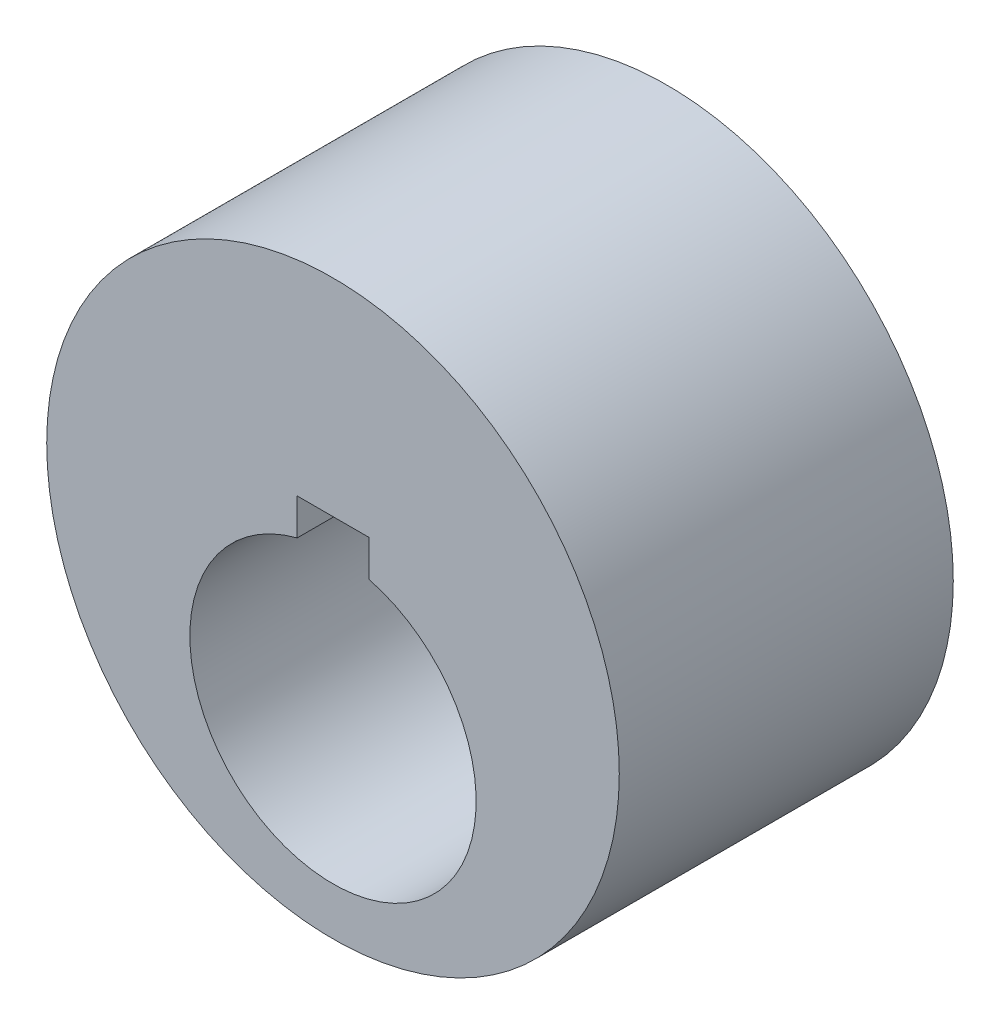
ISO-10303-21;
HEADER;
FILE_DESCRIPTION(('STEP AP214'),'2;1');
FILE_NAME('part.step','',(''),(''),'','','');
FILE_SCHEMA(('AUTOMOTIVE_DESIGN { 1 0 10303 214 1 1 1 1 }'));
ENDSEC;
DATA;
#1=APPLICATION_CONTEXT('core data for automotive mechanical design processes');
#2=APPLICATION_PROTOCOL_DEFINITION('international standard','automotive_design',2000,#1);
#3=PRODUCT_CONTEXT('',#1,'mechanical');
#4=PRODUCT('Part','Part','',(#3));
#5=PRODUCT_RELATED_PRODUCT_CATEGORY('part','',(#4));
#6=PRODUCT_DEFINITION_FORMATION('','',#4);
#7=PRODUCT_DEFINITION_CONTEXT('part definition',#1,'design');
#8=PRODUCT_DEFINITION('design','',#6,#7);
#9=PRODUCT_DEFINITION_SHAPE('','',#8);
#10=(LENGTH_UNIT() NAMED_UNIT(*) SI_UNIT(.MILLI.,.METRE.));
#11=(NAMED_UNIT(*) PLANE_ANGLE_UNIT() SI_UNIT($,.RADIAN.));
#12=(NAMED_UNIT(*) SI_UNIT($,.STERADIAN.) SOLID_ANGLE_UNIT());
#13=UNCERTAINTY_MEASURE_WITH_UNIT(LENGTH_MEASURE(1.E-05),#10,'distance_accuracy_value','');
#14=(GEOMETRIC_REPRESENTATION_CONTEXT(3) GLOBAL_UNCERTAINTY_ASSIGNED_CONTEXT((#13)) GLOBAL_UNIT_ASSIGNED_CONTEXT((#10,
#11,#12)) REPRESENTATION_CONTEXT('',''));
#15=CARTESIAN_POINT('',(0.,0.,0.));
#16=DIRECTION('',(0.,0.,1.));
#17=DIRECTION('',(1.,0.,0.));
#18=AXIS2_PLACEMENT_3D('',#15,#16,#17);
#19=CARTESIAN_POINT('',(0.,12.,42.));
#20=DIRECTION('',(0.,0.,-1.));
#21=DIRECTION('',(-1.,0.,0.));
#22=AXIS2_PLACEMENT_3D('',#19,#20,#21);
#23=CYLINDRICAL_SURFACE('',#22,36.);
#24=CARTESIAN_POINT('',(0.,12.,42.));
#25=DIRECTION('',(0.,0.,-1.));
#26=DIRECTION('',(-1.,0.,0.));
#27=AXIS2_PLACEMENT_3D('',#24,#25,#26);
#28=CIRCLE('',#27,36.);
#29=CARTESIAN_POINT('',(-36.,12.,42.));
#30=VERTEX_POINT('',#29);
#31=EDGE_CURVE('E11',#30,#30,#28,.T.);
#32=ORIENTED_EDGE('',*,*,#31,.T.);
#33=EDGE_LOOP('',(#32));
#34=FACE_BOUND('',#33,.T.);
#35=CARTESIAN_POINT('',(0.,12.,0.));
#36=DIRECTION('',(0.,0.,-1.));
#37=DIRECTION('',(-1.,0.,0.));
#38=AXIS2_PLACEMENT_3D('',#35,#36,#37);
#39=CIRCLE('',#38,36.);
#40=CARTESIAN_POINT('',(-36.,12.,0.));
#41=VERTEX_POINT('',#40);
#42=EDGE_CURVE('E44',#41,#41,#39,.T.);
#43=ORIENTED_EDGE('',*,*,#42,.F.);
#44=EDGE_LOOP('',(#43));
#45=FACE_BOUND('',#44,.T.);
#46=ADVANCED_FACE('F37',(#34,#45),#23,.T.);
#47=CARTESIAN_POINT('',(36.,12.,42.));
#48=DIRECTION('',(0.,0.,1.));
#49=DIRECTION('',(1.,0.,0.));
#50=AXIS2_PLACEMENT_3D('',#47,#48,#49);
#51=PLANE('',#50);
#52=CARTESIAN_POINT('',(0.,0.,42.));
#53=DIRECTION('',(0.,0.,1.));
#54=DIRECTION('',(1.,0.,0.));
#55=AXIS2_PLACEMENT_3D('',#52,#53,#54);
#56=CIRCLE('',#55,18.);
#57=CARTESIAN_POINT('',(-4.5,17.4284250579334,42.));
#58=VERTEX_POINT('',#57);
#59=CARTESIAN_POINT('',(4.50000000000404,17.4284250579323,42.));
#60=VERTEX_POINT('',#59);
#61=EDGE_CURVE('E92',#58,#60,#56,.T.);
#62=ORIENTED_EDGE('',*,*,#61,.F.);
#63=DIRECTION('',(0.,1.,0.));
#64=VECTOR('',#63,1.);
#65=CARTESIAN_POINT('',(-4.5,17.4284250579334,42.));
#66=LINE('',#65,#64);
#67=CARTESIAN_POINT('',(-4.5,22.,42.));
#68=VERTEX_POINT('',#67);
#69=EDGE_CURVE('E102',#58,#68,#66,.T.);
#70=ORIENTED_EDGE('',*,*,#69,.T.);
#71=DIRECTION('',(1.,0.,0.));
#72=VECTOR('',#71,1.);
#73=CARTESIAN_POINT('',(-4.5,22.,42.));
#74=LINE('',#73,#72);
#75=CARTESIAN_POINT('',(4.50000000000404,22.,42.));
#76=VERTEX_POINT('',#75);
#77=EDGE_CURVE('E114',#68,#76,#74,.T.);
#78=ORIENTED_EDGE('',*,*,#77,.T.);
#79=DIRECTION('',(0.,-1.,0.));
#80=VECTOR('',#79,1.);
#81=CARTESIAN_POINT('',(4.50000000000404,22.,42.));
#82=LINE('',#81,#80);
#83=EDGE_CURVE('E99',#76,#60,#82,.T.);
#84=ORIENTED_EDGE('',*,*,#83,.T.);
#85=EDGE_LOOP('',(#62,#70,#78,#84));
#86=FACE_BOUND('',#85,.T.);
#87=ORIENTED_EDGE('',*,*,#31,.F.);
#88=EDGE_LOOP('',(#87));
#89=FACE_BOUND('',#88,.T.);
#90=ADVANCED_FACE('F126',(#86,#89),#51,.T.);
#91=CARTESIAN_POINT('',(0.,12.,0.));
#92=DIRECTION('',(0.,0.,-1.));
#93=DIRECTION('',(-1.,0.,0.));
#94=AXIS2_PLACEMENT_3D('',#91,#92,#93);
#95=PLANE('',#94);
#96=CARTESIAN_POINT('',(0.,42.,0.));
#97=DIRECTION('',(0.,0.,-1.));
#98=DIRECTION('',(-1.,0.,0.));
#99=AXIS2_PLACEMENT_3D('',#96,#97,#98);
#100=CIRCLE('',#99,2.99999999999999);
#101=CARTESIAN_POINT('',(-2.99999999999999,42.,0.));
#102=VERTEX_POINT('',#101);
#103=EDGE_CURVE('E89',#102,#102,#100,.T.);
#104=ORIENTED_EDGE('',*,*,#103,.F.);
#105=EDGE_LOOP('',(#104));
#106=FACE_BOUND('',#105,.T.);
#107=CARTESIAN_POINT('',(0.,0.,0.));
#108=DIRECTION('',(0.,0.,1.));
#109=DIRECTION('',(1.,0.,0.));
#110=AXIS2_PLACEMENT_3D('',#107,#108,#109);
#111=CIRCLE('',#110,18.);
#112=CARTESIAN_POINT('',(-4.5,17.4284250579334,0.));
#113=VERTEX_POINT('',#112);
#114=CARTESIAN_POINT('',(4.50000000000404,17.4284250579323,0.));
#115=VERTEX_POINT('',#114);
#116=EDGE_CURVE('E96',#113,#115,#111,.T.);
#117=ORIENTED_EDGE('',*,*,#116,.T.);
#118=DIRECTION('',(0.,-1.,0.));
#119=VECTOR('',#118,1.);
#120=CARTESIAN_POINT('',(4.50000000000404,22.,0.));
#121=LINE('',#120,#119);
#122=CARTESIAN_POINT('',(4.50000000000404,22.,0.));
#123=VERTEX_POINT('',#122);
#124=EDGE_CURVE('E108',#123,#115,#121,.T.);
#125=ORIENTED_EDGE('',*,*,#124,.F.);
#126=DIRECTION('',(1.,0.,0.));
#127=VECTOR('',#126,1.);
#128=CARTESIAN_POINT('',(-4.5,22.,0.));
#129=LINE('',#128,#127);
#130=CARTESIAN_POINT('',(-4.5,22.,0.));
#131=VERTEX_POINT('',#130);
#132=EDGE_CURVE('E106',#131,#123,#129,.T.);
#133=ORIENTED_EDGE('',*,*,#132,.F.);
#134=DIRECTION('',(0.,1.,0.));
#135=VECTOR('',#134,1.);
#136=CARTESIAN_POINT('',(-4.5,17.4284250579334,0.));
#137=LINE('',#136,#135);
#138=EDGE_CURVE('E59',#113,#131,#137,.T.);
#139=ORIENTED_EDGE('',*,*,#138,.F.);
#140=EDGE_LOOP('',(#117,#125,#133,#139));
#141=FACE_BOUND('',#140,.T.);
#142=ORIENTED_EDGE('',*,*,#42,.T.);
#143=EDGE_LOOP('',(#142));
#144=FACE_BOUND('',#143,.T.);
#145=ADVANCED_FACE('F123',(#106,#141,#144),#95,.T.);
#146=CARTESIAN_POINT('',(-4.5,17.4284250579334,42.001));
#147=DIRECTION('',(-1.,0.,0.));
#148=DIRECTION('',(0.,0.,1.));
#149=AXIS2_PLACEMENT_3D('',#146,#147,#148);
#150=PLANE('',#149);
#151=DIRECTION('',(0.,0.,-1.));
#152=VECTOR('',#151,1.);
#153=CARTESIAN_POINT('',(-4.5,17.4284250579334,42.001));
#154=LINE('',#153,#152);
#155=EDGE_CURVE('E112',#58,#113,#154,.T.);
#156=ORIENTED_EDGE('',*,*,#155,.T.);
#157=ORIENTED_EDGE('',*,*,#138,.T.);
#158=DIRECTION('',(0.,0.,-1.));
#159=VECTOR('',#158,1.);
#160=CARTESIAN_POINT('',(-4.5,22.,42.001));
#161=LINE('',#160,#159);
#162=EDGE_CURVE('E111',#68,#131,#161,.T.);
#163=ORIENTED_EDGE('',*,*,#162,.F.);
#164=ORIENTED_EDGE('',*,*,#69,.F.);
#165=EDGE_LOOP('',(#156,#157,#163,#164));
#166=FACE_BOUND('',#165,.T.);
#167=ADVANCED_FACE('F137',(#166),#150,.F.);
#168=CARTESIAN_POINT('',(4.50000000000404,22.,42.001));
#169=DIRECTION('',(1.,0.,0.));
#170=DIRECTION('',(0.,1.,0.));
#171=AXIS2_PLACEMENT_3D('',#168,#169,#170);
#172=PLANE('',#171);
#173=DIRECTION('',(0.,0.,-1.));
#174=VECTOR('',#173,1.);
#175=CARTESIAN_POINT('',(4.50000000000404,22.,42.001));
#176=LINE('',#175,#174);
#177=EDGE_CURVE('E51',#76,#123,#176,.T.);
#178=ORIENTED_EDGE('',*,*,#177,.T.);
#179=ORIENTED_EDGE('',*,*,#124,.T.);
#180=DIRECTION('',(0.,0.,-1.));
#181=VECTOR('',#180,1.);
#182=CARTESIAN_POINT('',(4.50000000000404,17.4284250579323,42.001));
#183=LINE('',#182,#181);
#184=EDGE_CURVE('E115',#60,#115,#183,.T.);
#185=ORIENTED_EDGE('',*,*,#184,.F.);
#186=ORIENTED_EDGE('',*,*,#83,.F.);
#187=EDGE_LOOP('',(#178,#179,#185,#186));
#188=FACE_BOUND('',#187,.T.);
#189=ADVANCED_FACE('F144',(#188),#172,.F.);
#190=CARTESIAN_POINT('',(-4.5,22.,42.001));
#191=DIRECTION('',(0.,1.,0.));
#192=DIRECTION('',(0.,0.,1.));
#193=AXIS2_PLACEMENT_3D('',#190,#191,#192);
#194=PLANE('',#193);
#195=ORIENTED_EDGE('',*,*,#162,.T.);
#196=ORIENTED_EDGE('',*,*,#132,.T.);
#197=ORIENTED_EDGE('',*,*,#177,.F.);
#198=ORIENTED_EDGE('',*,*,#77,.F.);
#199=EDGE_LOOP('',(#195,#196,#197,#198));
#200=FACE_BOUND('',#199,.T.);
#201=ADVANCED_FACE('F145',(#200),#194,.F.);
#202=CARTESIAN_POINT('',(0.,0.,0.));
#203=DIRECTION('',(0.,0.,1.));
#204=DIRECTION('',(1.,0.,0.));
#205=AXIS2_PLACEMENT_3D('',#202,#203,#204);
#206=CYLINDRICAL_SURFACE('',#205,18.);
#207=ORIENTED_EDGE('',*,*,#61,.T.);
#208=ORIENTED_EDGE('',*,*,#184,.T.);
#209=ORIENTED_EDGE('',*,*,#116,.F.);
#210=ORIENTED_EDGE('',*,*,#155,.F.);
#211=EDGE_LOOP('',(#207,#208,#209,#210));
#212=FACE_BOUND('',#211,.T.);
#213=ADVANCED_FACE('F148',(#212),#206,.F.);
#214=CARTESIAN_POINT('',(0.,42.,0.));
#215=DIRECTION('',(0.,0.,-1.));
#216=DIRECTION('',(-1.,0.,0.));
#217=AXIS2_PLACEMENT_3D('',#214,#215,#216);
#218=CYLINDRICAL_SURFACE('',#217,2.99999999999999);
#219=CARTESIAN_POINT('',(0.,42.,14.));
#220=DIRECTION('',(0.,0.,-1.));
#221=DIRECTION('',(-1.,0.,0.));
#222=AXIS2_PLACEMENT_3D('',#219,#220,#221);
#223=CIRCLE('',#222,2.99999999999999);
#224=CARTESIAN_POINT('',(-2.99999999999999,42.,14.));
#225=VERTEX_POINT('',#224);
#226=EDGE_CURVE('E87',#225,#225,#223,.T.);
#227=ORIENTED_EDGE('',*,*,#226,.F.);
#228=EDGE_LOOP('',(#227));
#229=FACE_BOUND('',#228,.T.);
#230=ORIENTED_EDGE('',*,*,#103,.T.);
#231=EDGE_LOOP('',(#230));
#232=FACE_BOUND('',#231,.T.);
#233=ADVANCED_FACE('F83',(#229,#232),#218,.F.);
#234=CARTESIAN_POINT('',(0.,42.,14.));
#235=DIRECTION('',(0.,0.,-1.));
#236=DIRECTION('',(-1.,0.,0.));
#237=AXIS2_PLACEMENT_3D('',#234,#235,#236);
#238=CONICAL_SURFACE('',#237,2.99999999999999,1.04719755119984);
#239=CARTESIAN_POINT('',(0.,42.,15.7320508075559));
#240=VERTEX_POINT('',#239);
#241=VERTEX_LOOP('',#240);
#242=FACE_BOUND('',#241,.T.);
#243=ORIENTED_EDGE('',*,*,#226,.T.);
#244=EDGE_LOOP('',(#243));
#245=FACE_BOUND('',#244,.T.);
#246=ADVANCED_FACE('F80',(#242,#245),#238,.F.);
#247=CLOSED_SHELL('',(#46,#90,#145,#167,#189,#201,#213,#233,#246));
#248=MANIFOLD_SOLID_BREP('B2',#247);
#249=ADVANCED_BREP_SHAPE_REPRESENTATION('',(#18,#248),#14);
#250=SHAPE_DEFINITION_REPRESENTATION(#9,#249);
ENDSEC;
END-ISO-10303-21;
